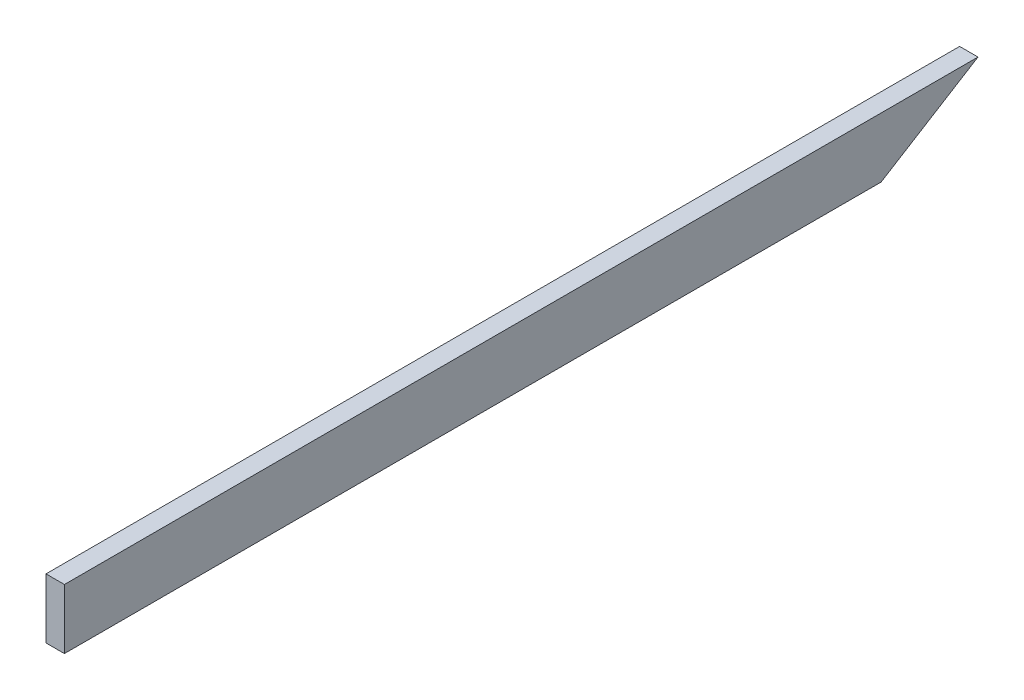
from build123d import *

# Parameters (mm, degrees)
ESQUISSE1_W             = 4
ESQUISSE1_H             = 13
EXTRUSION1_DEPTH        = 150
ENL_V_MAT_EXTRU_1_DEPTH = 10


with BuildPart() as part:
    # Esquisse1 → Extrusion1 (new, symmetric)
    with BuildSketch(Plane.XY):
        Rectangle(ESQUISSE1_W, ESQUISSE1_H)
    extrude(amount=EXTRUSION1_DEPTH, both=True)

    # Esquisse2 → Enl_v. mat.-Extru.1 (cut)
    with BuildSketch(Plane(origin=(2, 0, 0), x_dir=(0, 0, -1), z_dir=(1, 0, 0))):
        Polygon((27.400841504, -6.5), (48.448460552, 6.5), (150, 6.5), (150, -6.5), align=None)
    extrude(amount=-ENL_V_MAT_EXTRU_1_DEPTH, mode=Mode.SUBTRACT)


solid = part.part
